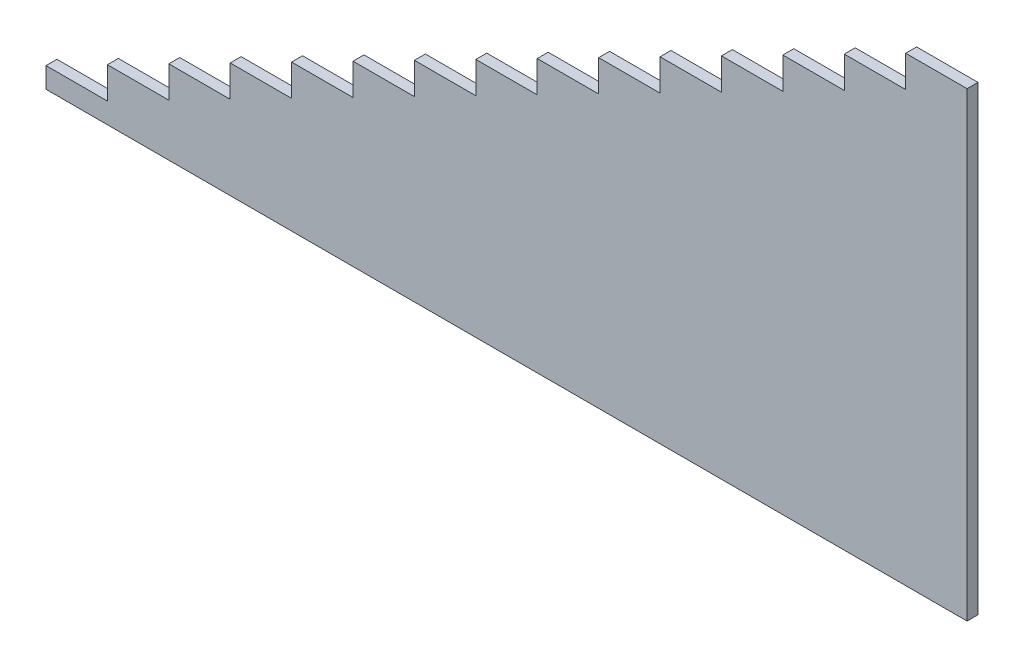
ISO-10303-21;
HEADER;
FILE_DESCRIPTION(('STEP AP214'),'2;1');
FILE_NAME('part.step','',(''),(''),'','','');
FILE_SCHEMA(('AUTOMOTIVE_DESIGN { 1 0 10303 214 1 1 1 1 }'));
ENDSEC;
DATA;
#1=APPLICATION_CONTEXT('core data for automotive mechanical design processes');
#2=APPLICATION_PROTOCOL_DEFINITION('international standard','automotive_design',2000,#1);
#3=PRODUCT_CONTEXT('',#1,'mechanical');
#4=PRODUCT('Part','Part','',(#3));
#5=PRODUCT_RELATED_PRODUCT_CATEGORY('part','',(#4));
#6=PRODUCT_DEFINITION_FORMATION('','',#4);
#7=PRODUCT_DEFINITION_CONTEXT('part definition',#1,'design');
#8=PRODUCT_DEFINITION('design','',#6,#7);
#9=PRODUCT_DEFINITION_SHAPE('','',#8);
#10=(LENGTH_UNIT() NAMED_UNIT(*) SI_UNIT(.MILLI.,.METRE.));
#11=(NAMED_UNIT(*) PLANE_ANGLE_UNIT() SI_UNIT($,.RADIAN.));
#12=(NAMED_UNIT(*) SI_UNIT($,.STERADIAN.) SOLID_ANGLE_UNIT());
#13=UNCERTAINTY_MEASURE_WITH_UNIT(LENGTH_MEASURE(1.E-05),#10,'distance_accuracy_value','');
#14=(GEOMETRIC_REPRESENTATION_CONTEXT(3) GLOBAL_UNCERTAINTY_ASSIGNED_CONTEXT((#13)) GLOBAL_UNIT_ASSIGNED_CONTEXT((#10,
#11,#12)) REPRESENTATION_CONTEXT('',''));
#15=CARTESIAN_POINT('',(0.,0.,0.));
#16=DIRECTION('',(0.,0.,1.));
#17=DIRECTION('',(1.,0.,0.));
#18=AXIS2_PLACEMENT_3D('',#15,#16,#17);
#19=CARTESIAN_POINT('',(0.,0.,12.7));
#20=DIRECTION('',(0.,-1.,0.));
#21=DIRECTION('',(1.,0.,0.));
#22=AXIS2_PLACEMENT_3D('',#19,#20,#21);
#23=PLANE('',#22);
#24=DIRECTION('',(-1.,0.,0.));
#25=VECTOR('',#24,1.);
#26=CARTESIAN_POINT('',(0.,0.,0.));
#27=LINE('',#26,#25);
#28=CARTESIAN_POINT('',(0.,0.,0.));
#29=VERTEX_POINT('',#28);
#30=CARTESIAN_POINT('',(-1070.61,6.10622663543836E-13,0.));
#31=VERTEX_POINT('',#30);
#32=EDGE_CURVE('E271',#29,#31,#27,.T.);
#33=ORIENTED_EDGE('',*,*,#32,.F.);
#34=DIRECTION('',(0.,0.,-1.));
#35=VECTOR('',#34,1.);
#36=CARTESIAN_POINT('',(0.,0.,12.7));
#37=LINE('',#36,#35);
#38=CARTESIAN_POINT('',(0.,0.,12.7));
#39=VERTEX_POINT('',#38);
#40=EDGE_CURVE('E11',#39,#29,#37,.T.);
#41=ORIENTED_EDGE('',*,*,#40,.F.);
#42=DIRECTION('',(-1.,0.,0.));
#43=VECTOR('',#42,1.);
#44=CARTESIAN_POINT('',(0.,0.,12.7));
#45=LINE('',#44,#43);
#46=CARTESIAN_POINT('',(-1070.61,6.10622663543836E-13,12.7));
#47=VERTEX_POINT('',#46);
#48=EDGE_CURVE('E338',#39,#47,#45,.T.);
#49=ORIENTED_EDGE('',*,*,#48,.T.);
#50=DIRECTION('',(0.,0.,-1.));
#51=VECTOR('',#50,1.);
#52=CARTESIAN_POINT('',(-1070.61,6.10622663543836E-13,12.7));
#53=LINE('',#52,#51);
#54=EDGE_CURVE('E157',#47,#31,#53,.T.);
#55=ORIENTED_EDGE('',*,*,#54,.T.);
#56=EDGE_LOOP('',(#33,#41,#49,#55));
#57=FACE_BOUND('',#56,.T.);
#58=ADVANCED_FACE('F34',(#57),#23,.T.);
#59=CARTESIAN_POINT('',(0.,0.,12.7));
#60=DIRECTION('',(-1.,0.,0.));
#61=DIRECTION('',(0.,-1.,0.));
#62=AXIS2_PLACEMENT_3D('',#59,#60,#61);
#63=PLANE('',#62);
#64=DIRECTION('',(0.,1.,0.));
#65=VECTOR('',#64,1.);
#66=CARTESIAN_POINT('',(0.,0.,0.));
#67=LINE('',#66,#65);
#68=CARTESIAN_POINT('',(0.,535.94,0.));
#69=VERTEX_POINT('',#68);
#70=EDGE_CURVE('E274',#29,#69,#67,.T.);
#71=ORIENTED_EDGE('',*,*,#70,.T.);
#72=DIRECTION('',(0.,0.,-1.));
#73=VECTOR('',#72,1.);
#74=CARTESIAN_POINT('',(0.,535.94,12.7));
#75=LINE('',#74,#73);
#76=CARTESIAN_POINT('',(0.,535.94,12.7));
#77=VERTEX_POINT('',#76);
#78=EDGE_CURVE('E42',#77,#69,#75,.T.);
#79=ORIENTED_EDGE('',*,*,#78,.F.);
#80=DIRECTION('',(0.,1.,0.));
#81=VECTOR('',#80,1.);
#82=CARTESIAN_POINT('',(0.,0.,12.7));
#83=LINE('',#82,#81);
#84=EDGE_CURVE('E440',#39,#77,#83,.T.);
#85=ORIENTED_EDGE('',*,*,#84,.F.);
#86=ORIENTED_EDGE('',*,*,#40,.T.);
#87=EDGE_LOOP('',(#71,#79,#85,#86));
#88=FACE_BOUND('',#87,.T.);
#89=ADVANCED_FACE('F425',(#88),#63,.F.);
#90=CARTESIAN_POINT('',(0.,535.94,12.7));
#91=DIRECTION('',(0.,1.,0.));
#92=DIRECTION('',(0.,0.,1.));
#93=AXIS2_PLACEMENT_3D('',#90,#91,#92);
#94=PLANE('',#93);
#95=DIRECTION('',(1.,0.,0.));
#96=VECTOR('',#95,1.);
#97=CARTESIAN_POINT('',(0.,535.94,0.));
#98=LINE('',#97,#96);
#99=CARTESIAN_POINT('',(-71.374,535.94,0.));
#100=VERTEX_POINT('',#99);
#101=EDGE_CURVE('E277',#100,#69,#98,.T.);
#102=ORIENTED_EDGE('',*,*,#101,.F.);
#103=DIRECTION('',(0.,0.,-1.));
#104=VECTOR('',#103,1.);
#105=CARTESIAN_POINT('',(-71.374,535.94,12.7));
#106=LINE('',#105,#104);
#107=CARTESIAN_POINT('',(-71.374,535.94,12.7));
#108=VERTEX_POINT('',#107);
#109=EDGE_CURVE('E415',#108,#100,#106,.T.);
#110=ORIENTED_EDGE('',*,*,#109,.F.);
#111=DIRECTION('',(1.,0.,0.));
#112=VECTOR('',#111,1.);
#113=CARTESIAN_POINT('',(0.,535.94,12.7));
#114=LINE('',#113,#112);
#115=EDGE_CURVE('E422',#108,#77,#114,.T.);
#116=ORIENTED_EDGE('',*,*,#115,.T.);
#117=ORIENTED_EDGE('',*,*,#78,.T.);
#118=EDGE_LOOP('',(#102,#110,#116,#117));
#119=FACE_BOUND('',#118,.T.);
#120=ADVANCED_FACE('F420',(#119),#94,.T.);
#121=CARTESIAN_POINT('',(-71.374,0.,12.7));
#122=DIRECTION('',(1.,0.,0.));
#123=DIRECTION('',(0.,0.,-1.));
#124=AXIS2_PLACEMENT_3D('',#121,#122,#123);
#125=PLANE('',#124);
#126=DIRECTION('',(0.,-1.,0.));
#127=VECTOR('',#126,1.);
#128=CARTESIAN_POINT('',(-71.374,0.,0.));
#129=LINE('',#128,#127);
#130=CARTESIAN_POINT('',(-71.374,499.364,0.));
#131=VERTEX_POINT('',#130);
#132=EDGE_CURVE('E280',#100,#131,#129,.T.);
#133=ORIENTED_EDGE('',*,*,#132,.T.);
#134=DIRECTION('',(0.,0.,-1.));
#135=VECTOR('',#134,1.);
#136=CARTESIAN_POINT('',(-71.374,499.364,12.7));
#137=LINE('',#136,#135);
#138=CARTESIAN_POINT('',(-71.374,499.364,12.7));
#139=VERTEX_POINT('',#138);
#140=EDGE_CURVE('E413',#139,#131,#137,.T.);
#141=ORIENTED_EDGE('',*,*,#140,.F.);
#142=DIRECTION('',(0.,-1.,0.));
#143=VECTOR('',#142,1.);
#144=CARTESIAN_POINT('',(-71.374,0.,12.7));
#145=LINE('',#144,#143);
#146=EDGE_CURVE('E436',#108,#139,#145,.T.);
#147=ORIENTED_EDGE('',*,*,#146,.F.);
#148=ORIENTED_EDGE('',*,*,#109,.T.);
#149=EDGE_LOOP('',(#133,#141,#147,#148));
#150=FACE_BOUND('',#149,.T.);
#151=ADVANCED_FACE('F433',(#150),#125,.F.);
#152=CARTESIAN_POINT('',(0.,499.364,12.7));
#153=DIRECTION('',(0.,1.,0.));
#154=DIRECTION('',(0.,0.,1.));
#155=AXIS2_PLACEMENT_3D('',#152,#153,#154);
#156=PLANE('',#155);
#157=DIRECTION('',(1.,0.,0.));
#158=VECTOR('',#157,1.);
#159=CARTESIAN_POINT('',(0.,499.364,0.));
#160=LINE('',#159,#158);
#161=CARTESIAN_POINT('',(-142.748,499.364,0.));
#162=VERTEX_POINT('',#161);
#163=EDGE_CURVE('E283',#162,#131,#160,.T.);
#164=ORIENTED_EDGE('',*,*,#163,.F.);
#165=DIRECTION('',(0.,0.,-1.));
#166=VECTOR('',#165,1.);
#167=CARTESIAN_POINT('',(-142.748,499.364,12.7));
#168=LINE('',#167,#166);
#169=CARTESIAN_POINT('',(-142.748,499.364,12.7));
#170=VERTEX_POINT('',#169);
#171=EDGE_CURVE('E411',#170,#162,#168,.T.);
#172=ORIENTED_EDGE('',*,*,#171,.F.);
#173=DIRECTION('',(1.,0.,0.));
#174=VECTOR('',#173,1.);
#175=CARTESIAN_POINT('',(0.,499.364,12.7));
#176=LINE('',#175,#174);
#177=EDGE_CURVE('E438',#170,#139,#176,.T.);
#178=ORIENTED_EDGE('',*,*,#177,.T.);
#179=ORIENTED_EDGE('',*,*,#140,.T.);
#180=EDGE_LOOP('',(#164,#172,#178,#179));
#181=FACE_BOUND('',#180,.T.);
#182=ADVANCED_FACE('F515',(#181),#156,.T.);
#183=CARTESIAN_POINT('',(-142.748000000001,3.31885819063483E-13,12.7));
#184=DIRECTION('',(1.,0.,0.));
#185=DIRECTION('',(0.,1.,0.));
#186=AXIS2_PLACEMENT_3D('',#183,#184,#185);
#187=PLANE('',#186);
#188=DIRECTION('',(0.,-1.,0.));
#189=VECTOR('',#188,1.);
#190=CARTESIAN_POINT('',(-142.748000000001,3.31885819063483E-13,0.));
#191=LINE('',#190,#189);
#192=CARTESIAN_POINT('',(-142.748,462.788,0.));
#193=VERTEX_POINT('',#192);
#194=EDGE_CURVE('E286',#162,#193,#191,.T.);
#195=ORIENTED_EDGE('',*,*,#194,.T.);
#196=DIRECTION('',(0.,0.,-1.));
#197=VECTOR('',#196,1.);
#198=CARTESIAN_POINT('',(-142.748,462.788,12.7));
#199=LINE('',#198,#197);
#200=CARTESIAN_POINT('',(-142.748,462.788,12.7));
#201=VERTEX_POINT('',#200);
#202=EDGE_CURVE('E408',#201,#193,#199,.T.);
#203=ORIENTED_EDGE('',*,*,#202,.F.);
#204=DIRECTION('',(0.,-1.,0.));
#205=VECTOR('',#204,1.);
#206=CARTESIAN_POINT('',(-142.748000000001,3.31885819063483E-13,12.7));
#207=LINE('',#206,#205);
#208=EDGE_CURVE('E446',#170,#201,#207,.T.);
#209=ORIENTED_EDGE('',*,*,#208,.F.);
#210=ORIENTED_EDGE('',*,*,#171,.T.);
#211=EDGE_LOOP('',(#195,#203,#209,#210));
#212=FACE_BOUND('',#211,.T.);
#213=ADVANCED_FACE('F518',(#212),#187,.F.);
#214=CARTESIAN_POINT('',(0.,462.788,12.7));
#215=DIRECTION('',(0.,-1.,0.));
#216=DIRECTION('',(0.,0.,-1.));
#217=AXIS2_PLACEMENT_3D('',#214,#215,#216);
#218=PLANE('',#217);
#219=DIRECTION('',(-1.,0.,0.));
#220=VECTOR('',#219,1.);
#221=CARTESIAN_POINT('',(0.,462.788,0.));
#222=LINE('',#221,#220);
#223=CARTESIAN_POINT('',(-214.122,462.788,0.));
#224=VERTEX_POINT('',#223);
#225=EDGE_CURVE('E288',#193,#224,#222,.T.);
#226=ORIENTED_EDGE('',*,*,#225,.T.);
#227=DIRECTION('',(0.,0.,-1.));
#228=VECTOR('',#227,1.);
#229=CARTESIAN_POINT('',(-214.122,462.788,12.7));
#230=LINE('',#229,#228);
#231=CARTESIAN_POINT('',(-214.122,462.788,12.7));
#232=VERTEX_POINT('',#231);
#233=EDGE_CURVE('E405',#232,#224,#230,.T.);
#234=ORIENTED_EDGE('',*,*,#233,.F.);
#235=DIRECTION('',(-1.,0.,0.));
#236=VECTOR('',#235,1.);
#237=CARTESIAN_POINT('',(0.,462.788,12.7));
#238=LINE('',#237,#236);
#239=EDGE_CURVE('E448',#201,#232,#238,.T.);
#240=ORIENTED_EDGE('',*,*,#239,.F.);
#241=ORIENTED_EDGE('',*,*,#202,.T.);
#242=EDGE_LOOP('',(#226,#234,#240,#241));
#243=FACE_BOUND('',#242,.T.);
#244=ADVANCED_FACE('F522',(#243),#218,.F.);
#245=CARTESIAN_POINT('',(-214.122,0.,12.7));
#246=DIRECTION('',(1.,0.,0.));
#247=DIRECTION('',(0.,0.,-1.));
#248=AXIS2_PLACEMENT_3D('',#245,#246,#247);
#249=PLANE('',#248);
#250=DIRECTION('',(0.,-1.,0.));
#251=VECTOR('',#250,1.);
#252=CARTESIAN_POINT('',(-214.122,0.,0.));
#253=LINE('',#252,#251);
#254=CARTESIAN_POINT('',(-214.122,426.212,0.));
#255=VERTEX_POINT('',#254);
#256=EDGE_CURVE('E290',#224,#255,#253,.T.);
#257=ORIENTED_EDGE('',*,*,#256,.T.);
#258=DIRECTION('',(0.,0.,-1.));
#259=VECTOR('',#258,1.);
#260=CARTESIAN_POINT('',(-214.122,426.212,12.7));
#261=LINE('',#260,#259);
#262=CARTESIAN_POINT('',(-214.122,426.212,12.7));
#263=VERTEX_POINT('',#262);
#264=EDGE_CURVE('E402',#263,#255,#261,.T.);
#265=ORIENTED_EDGE('',*,*,#264,.F.);
#266=DIRECTION('',(0.,-1.,0.));
#267=VECTOR('',#266,1.);
#268=CARTESIAN_POINT('',(-214.122,0.,12.7));
#269=LINE('',#268,#267);
#270=EDGE_CURVE('E450',#232,#263,#269,.T.);
#271=ORIENTED_EDGE('',*,*,#270,.F.);
#272=ORIENTED_EDGE('',*,*,#233,.T.);
#273=EDGE_LOOP('',(#257,#265,#271,#272));
#274=FACE_BOUND('',#273,.T.);
#275=ADVANCED_FACE('F526',(#274),#249,.F.);
#276=CARTESIAN_POINT('',(0.,426.212,12.7));
#277=DIRECTION('',(0.,-1.,0.));
#278=DIRECTION('',(0.,0.,-1.));
#279=AXIS2_PLACEMENT_3D('',#276,#277,#278);
#280=PLANE('',#279);
#281=DIRECTION('',(-1.,0.,0.));
#282=VECTOR('',#281,1.);
#283=CARTESIAN_POINT('',(0.,426.212,0.));
#284=LINE('',#283,#282);
#285=CARTESIAN_POINT('',(-285.496,426.212,0.));
#286=VERTEX_POINT('',#285);
#287=EDGE_CURVE('E292',#255,#286,#284,.T.);
#288=ORIENTED_EDGE('',*,*,#287,.T.);
#289=DIRECTION('',(0.,0.,-1.));
#290=VECTOR('',#289,1.);
#291=CARTESIAN_POINT('',(-285.496,426.212,12.7));
#292=LINE('',#291,#290);
#293=CARTESIAN_POINT('',(-285.496,426.212,12.7));
#294=VERTEX_POINT('',#293);
#295=EDGE_CURVE('E399',#294,#286,#292,.T.);
#296=ORIENTED_EDGE('',*,*,#295,.F.);
#297=DIRECTION('',(-1.,0.,0.));
#298=VECTOR('',#297,1.);
#299=CARTESIAN_POINT('',(0.,426.212,12.7));
#300=LINE('',#299,#298);
#301=EDGE_CURVE('E452',#263,#294,#300,.T.);
#302=ORIENTED_EDGE('',*,*,#301,.F.);
#303=ORIENTED_EDGE('',*,*,#264,.T.);
#304=EDGE_LOOP('',(#288,#296,#302,#303));
#305=FACE_BOUND('',#304,.T.);
#306=ADVANCED_FACE('F530',(#305),#280,.F.);
#307=CARTESIAN_POINT('',(-285.496000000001,6.63771638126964E-13,12.7));
#308=DIRECTION('',(1.,0.,0.));
#309=DIRECTION('',(0.,1.,0.));
#310=AXIS2_PLACEMENT_3D('',#307,#308,#309);
#311=PLANE('',#310);
#312=DIRECTION('',(0.,-1.,0.));
#313=VECTOR('',#312,1.);
#314=CARTESIAN_POINT('',(-285.496000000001,6.63771638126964E-13,0.));
#315=LINE('',#314,#313);
#316=CARTESIAN_POINT('',(-285.496,389.636,0.));
#317=VERTEX_POINT('',#316);
#318=EDGE_CURVE('E294',#286,#317,#315,.T.);
#319=ORIENTED_EDGE('',*,*,#318,.T.);
#320=DIRECTION('',(0.,0.,-1.));
#321=VECTOR('',#320,1.);
#322=CARTESIAN_POINT('',(-285.496,389.636,12.7));
#323=LINE('',#322,#321);
#324=CARTESIAN_POINT('',(-285.496,389.636,12.7));
#325=VERTEX_POINT('',#324);
#326=EDGE_CURVE('E396',#325,#317,#323,.T.);
#327=ORIENTED_EDGE('',*,*,#326,.F.);
#328=DIRECTION('',(0.,-1.,0.));
#329=VECTOR('',#328,1.);
#330=CARTESIAN_POINT('',(-285.496000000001,6.63771638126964E-13,12.7));
#331=LINE('',#330,#329);
#332=EDGE_CURVE('E454',#294,#325,#331,.T.);
#333=ORIENTED_EDGE('',*,*,#332,.F.);
#334=ORIENTED_EDGE('',*,*,#295,.T.);
#335=EDGE_LOOP('',(#319,#327,#333,#334));
#336=FACE_BOUND('',#335,.T.);
#337=ADVANCED_FACE('F534',(#336),#311,.F.);
#338=CARTESIAN_POINT('',(-3.03039523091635E-13,389.636,12.7));
#339=DIRECTION('',(0.,-1.,0.));
#340=DIRECTION('',(1.,0.,0.));
#341=AXIS2_PLACEMENT_3D('',#338,#339,#340);
#342=PLANE('',#341);
#343=DIRECTION('',(-1.,0.,0.));
#344=VECTOR('',#343,1.);
#345=CARTESIAN_POINT('',(-3.03039523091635E-13,389.636,0.));
#346=LINE('',#345,#344);
#347=CARTESIAN_POINT('',(-356.87,389.636,0.));
#348=VERTEX_POINT('',#347);
#349=EDGE_CURVE('E296',#317,#348,#346,.T.);
#350=ORIENTED_EDGE('',*,*,#349,.T.);
#351=DIRECTION('',(0.,0.,-1.));
#352=VECTOR('',#351,1.);
#353=CARTESIAN_POINT('',(-356.87,389.636,12.7));
#354=LINE('',#353,#352);
#355=CARTESIAN_POINT('',(-356.87,389.636,12.7));
#356=VERTEX_POINT('',#355);
#357=EDGE_CURVE('E393',#356,#348,#354,.T.);
#358=ORIENTED_EDGE('',*,*,#357,.F.);
#359=DIRECTION('',(-1.,0.,0.));
#360=VECTOR('',#359,1.);
#361=CARTESIAN_POINT('',(-3.03039523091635E-13,389.636,12.7));
#362=LINE('',#361,#360);
#363=EDGE_CURVE('E456',#325,#356,#362,.T.);
#364=ORIENTED_EDGE('',*,*,#363,.F.);
#365=ORIENTED_EDGE('',*,*,#326,.T.);
#366=EDGE_LOOP('',(#350,#358,#364,#365));
#367=FACE_BOUND('',#366,.T.);
#368=ADVANCED_FACE('F538',(#367),#342,.F.);
#369=CARTESIAN_POINT('',(-356.870000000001,8.29714547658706E-13,12.7));
#370=DIRECTION('',(1.,0.,0.));
#371=DIRECTION('',(0.,1.,0.));
#372=AXIS2_PLACEMENT_3D('',#369,#370,#371);
#373=PLANE('',#372);
#374=DIRECTION('',(0.,-1.,0.));
#375=VECTOR('',#374,1.);
#376=CARTESIAN_POINT('',(-356.870000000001,8.29714547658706E-13,0.));
#377=LINE('',#376,#375);
#378=CARTESIAN_POINT('',(-356.87,353.06,0.));
#379=VERTEX_POINT('',#378);
#380=EDGE_CURVE('E298',#348,#379,#377,.T.);
#381=ORIENTED_EDGE('',*,*,#380,.T.);
#382=DIRECTION('',(0.,0.,-1.));
#383=VECTOR('',#382,1.);
#384=CARTESIAN_POINT('',(-356.87,353.06,12.7));
#385=LINE('',#384,#383);
#386=CARTESIAN_POINT('',(-356.87,353.06,12.7));
#387=VERTEX_POINT('',#386);
#388=EDGE_CURVE('E390',#387,#379,#385,.T.);
#389=ORIENTED_EDGE('',*,*,#388,.F.);
#390=DIRECTION('',(0.,-1.,0.));
#391=VECTOR('',#390,1.);
#392=CARTESIAN_POINT('',(-356.870000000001,8.29714547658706E-13,12.7));
#393=LINE('',#392,#391);
#394=EDGE_CURVE('E458',#356,#387,#393,.T.);
#395=ORIENTED_EDGE('',*,*,#394,.F.);
#396=ORIENTED_EDGE('',*,*,#357,.T.);
#397=EDGE_LOOP('',(#381,#389,#395,#396));
#398=FACE_BOUND('',#397,.T.);
#399=ADVANCED_FACE('F542',(#398),#373,.F.);
#400=CARTESIAN_POINT('',(-2.74592527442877E-13,353.060000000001,12.7));
#401=DIRECTION('',(0.,-1.,0.));
#402=DIRECTION('',(1.,0.,0.));
#403=AXIS2_PLACEMENT_3D('',#400,#401,#402);
#404=PLANE('',#403);
#405=DIRECTION('',(-1.,0.,0.));
#406=VECTOR('',#405,1.);
#407=CARTESIAN_POINT('',(-2.74592527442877E-13,353.060000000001,0.));
#408=LINE('',#407,#406);
#409=CARTESIAN_POINT('',(-428.244,353.06,0.));
#410=VERTEX_POINT('',#409);
#411=EDGE_CURVE('E300',#379,#410,#408,.T.);
#412=ORIENTED_EDGE('',*,*,#411,.T.);
#413=DIRECTION('',(0.,0.,-1.));
#414=VECTOR('',#413,1.);
#415=CARTESIAN_POINT('',(-428.244,353.06,12.7));
#416=LINE('',#415,#414);
#417=CARTESIAN_POINT('',(-428.244,353.06,12.7));
#418=VERTEX_POINT('',#417);
#419=EDGE_CURVE('E387',#418,#410,#416,.T.);
#420=ORIENTED_EDGE('',*,*,#419,.F.);
#421=DIRECTION('',(-1.,0.,0.));
#422=VECTOR('',#421,1.);
#423=CARTESIAN_POINT('',(-2.74592527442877E-13,353.060000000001,12.7));
#424=LINE('',#423,#422);
#425=EDGE_CURVE('E460',#387,#418,#424,.T.);
#426=ORIENTED_EDGE('',*,*,#425,.F.);
#427=ORIENTED_EDGE('',*,*,#388,.T.);
#428=EDGE_LOOP('',(#412,#420,#426,#427));
#429=FACE_BOUND('',#428,.T.);
#430=ADVANCED_FACE('F546',(#429),#404,.F.);
#431=CARTESIAN_POINT('',(-428.244,0.,12.7));
#432=DIRECTION('',(1.,0.,0.));
#433=DIRECTION('',(0.,0.,-1.));
#434=AXIS2_PLACEMENT_3D('',#431,#432,#433);
#435=PLANE('',#434);
#436=DIRECTION('',(0.,-1.,0.));
#437=VECTOR('',#436,1.);
#438=CARTESIAN_POINT('',(-428.244,0.,0.));
#439=LINE('',#438,#437);
#440=CARTESIAN_POINT('',(-428.244,316.484,0.));
#441=VERTEX_POINT('',#440);
#442=EDGE_CURVE('E302',#410,#441,#439,.T.);
#443=ORIENTED_EDGE('',*,*,#442,.T.);
#444=DIRECTION('',(0.,0.,-1.));
#445=VECTOR('',#444,1.);
#446=CARTESIAN_POINT('',(-428.244,316.484,12.7));
#447=LINE('',#446,#445);
#448=CARTESIAN_POINT('',(-428.244,316.484,12.7));
#449=VERTEX_POINT('',#448);
#450=EDGE_CURVE('E384',#449,#441,#447,.T.);
#451=ORIENTED_EDGE('',*,*,#450,.F.);
#452=DIRECTION('',(0.,-1.,0.));
#453=VECTOR('',#452,1.);
#454=CARTESIAN_POINT('',(-428.244,0.,12.7));
#455=LINE('',#454,#453);
#456=EDGE_CURVE('E462',#418,#449,#455,.T.);
#457=ORIENTED_EDGE('',*,*,#456,.F.);
#458=ORIENTED_EDGE('',*,*,#419,.T.);
#459=EDGE_LOOP('',(#443,#451,#457,#458));
#460=FACE_BOUND('',#459,.T.);
#461=ADVANCED_FACE('F550',(#460),#435,.F.);
#462=CARTESIAN_POINT('',(-2.46145531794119E-13,316.484000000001,12.7));
#463=DIRECTION('',(0.,-1.,0.));
#464=DIRECTION('',(1.,0.,0.));
#465=AXIS2_PLACEMENT_3D('',#462,#463,#464);
#466=PLANE('',#465);
#467=DIRECTION('',(-1.,0.,0.));
#468=VECTOR('',#467,1.);
#469=CARTESIAN_POINT('',(-2.46145531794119E-13,316.484000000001,0.));
#470=LINE('',#469,#468);
#471=CARTESIAN_POINT('',(-499.618,316.484,0.));
#472=VERTEX_POINT('',#471);
#473=EDGE_CURVE('E304',#441,#472,#470,.T.);
#474=ORIENTED_EDGE('',*,*,#473,.T.);
#475=DIRECTION('',(0.,0.,-1.));
#476=VECTOR('',#475,1.);
#477=CARTESIAN_POINT('',(-499.618,316.484,12.7));
#478=LINE('',#477,#476);
#479=CARTESIAN_POINT('',(-499.618,316.484,12.7));
#480=VERTEX_POINT('',#479);
#481=EDGE_CURVE('E381',#480,#472,#478,.T.);
#482=ORIENTED_EDGE('',*,*,#481,.F.);
#483=DIRECTION('',(-1.,0.,0.));
#484=VECTOR('',#483,1.);
#485=CARTESIAN_POINT('',(-2.46145531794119E-13,316.484000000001,12.7));
#486=LINE('',#485,#484);
#487=EDGE_CURVE('E464',#449,#480,#486,.T.);
#488=ORIENTED_EDGE('',*,*,#487,.F.);
#489=ORIENTED_EDGE('',*,*,#450,.T.);
#490=EDGE_LOOP('',(#474,#482,#488,#489));
#491=FACE_BOUND('',#490,.T.);
#492=ADVANCED_FACE('F554',(#491),#466,.F.);
#493=CARTESIAN_POINT('',(-499.618000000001,1.16160036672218E-12,12.7));
#494=DIRECTION('',(1.,0.,0.));
#495=DIRECTION('',(0.,1.,0.));
#496=AXIS2_PLACEMENT_3D('',#493,#494,#495);
#497=PLANE('',#496);
#498=DIRECTION('',(0.,-1.,0.));
#499=VECTOR('',#498,1.);
#500=CARTESIAN_POINT('',(-499.618000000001,1.16160036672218E-12,0.));
#501=LINE('',#500,#499);
#502=CARTESIAN_POINT('',(-499.618,279.908,0.));
#503=VERTEX_POINT('',#502);
#504=EDGE_CURVE('E306',#472,#503,#501,.T.);
#505=ORIENTED_EDGE('',*,*,#504,.T.);
#506=DIRECTION('',(0.,0.,-1.));
#507=VECTOR('',#506,1.);
#508=CARTESIAN_POINT('',(-499.618,279.908,12.7));
#509=LINE('',#508,#507);
#510=CARTESIAN_POINT('',(-499.618,279.908,12.7));
#511=VERTEX_POINT('',#510);
#512=EDGE_CURVE('E378',#511,#503,#509,.T.);
#513=ORIENTED_EDGE('',*,*,#512,.F.);
#514=DIRECTION('',(0.,-1.,0.));
#515=VECTOR('',#514,1.);
#516=CARTESIAN_POINT('',(-499.618000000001,1.16160036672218E-12,12.7));
#517=LINE('',#516,#515);
#518=EDGE_CURVE('E466',#480,#511,#517,.T.);
#519=ORIENTED_EDGE('',*,*,#518,.F.);
#520=ORIENTED_EDGE('',*,*,#481,.T.);
#521=EDGE_LOOP('',(#505,#513,#519,#520));
#522=FACE_BOUND('',#521,.T.);
#523=ADVANCED_FACE('F558',(#522),#497,.F.);
#524=CARTESIAN_POINT('',(-2.17698536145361E-13,279.908000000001,12.7));
#525=DIRECTION('',(0.,-1.,0.));
#526=DIRECTION('',(1.,0.,0.));
#527=AXIS2_PLACEMENT_3D('',#524,#525,#526);
#528=PLANE('',#527);
#529=DIRECTION('',(-1.,0.,0.));
#530=VECTOR('',#529,1.);
#531=CARTESIAN_POINT('',(-2.17698536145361E-13,279.908000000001,0.));
#532=LINE('',#531,#530);
#533=CARTESIAN_POINT('',(-570.992,279.908,0.));
#534=VERTEX_POINT('',#533);
#535=EDGE_CURVE('E308',#503,#534,#532,.T.);
#536=ORIENTED_EDGE('',*,*,#535,.T.);
#537=DIRECTION('',(0.,0.,-1.));
#538=VECTOR('',#537,1.);
#539=CARTESIAN_POINT('',(-570.992,279.908,12.7));
#540=LINE('',#539,#538);
#541=CARTESIAN_POINT('',(-570.992,279.908,12.7));
#542=VERTEX_POINT('',#541);
#543=EDGE_CURVE('E375',#542,#534,#540,.T.);
#544=ORIENTED_EDGE('',*,*,#543,.F.);
#545=DIRECTION('',(-1.,0.,0.));
#546=VECTOR('',#545,1.);
#547=CARTESIAN_POINT('',(-2.17698536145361E-13,279.908000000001,12.7));
#548=LINE('',#547,#546);
#549=EDGE_CURVE('E468',#511,#542,#548,.T.);
#550=ORIENTED_EDGE('',*,*,#549,.F.);
#551=ORIENTED_EDGE('',*,*,#512,.T.);
#552=EDGE_LOOP('',(#536,#544,#550,#551));
#553=FACE_BOUND('',#552,.T.);
#554=ADVANCED_FACE('F562',(#553),#528,.F.);
#555=CARTESIAN_POINT('',(-570.992,0.,12.7));
#556=DIRECTION('',(1.,0.,0.));
#557=DIRECTION('',(0.,0.,-1.));
#558=AXIS2_PLACEMENT_3D('',#555,#556,#557);
#559=PLANE('',#558);
#560=DIRECTION('',(0.,-1.,0.));
#561=VECTOR('',#560,1.);
#562=CARTESIAN_POINT('',(-570.992,0.,0.));
#563=LINE('',#562,#561);
#564=CARTESIAN_POINT('',(-570.992,243.332000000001,0.));
#565=VERTEX_POINT('',#564);
#566=EDGE_CURVE('E310',#534,#565,#563,.T.);
#567=ORIENTED_EDGE('',*,*,#566,.T.);
#568=DIRECTION('',(0.,0.,-1.));
#569=VECTOR('',#568,1.);
#570=CARTESIAN_POINT('',(-570.992,243.332000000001,12.7));
#571=LINE('',#570,#569);
#572=CARTESIAN_POINT('',(-570.992,243.332000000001,12.7));
#573=VERTEX_POINT('',#572);
#574=EDGE_CURVE('E372',#573,#565,#571,.T.);
#575=ORIENTED_EDGE('',*,*,#574,.F.);
#576=DIRECTION('',(0.,-1.,0.));
#577=VECTOR('',#576,1.);
#578=CARTESIAN_POINT('',(-570.992,0.,12.7));
#579=LINE('',#578,#577);
#580=EDGE_CURVE('E470',#542,#573,#579,.T.);
#581=ORIENTED_EDGE('',*,*,#580,.F.);
#582=ORIENTED_EDGE('',*,*,#543,.T.);
#583=EDGE_LOOP('',(#567,#575,#581,#582));
#584=FACE_BOUND('',#583,.T.);
#585=ADVANCED_FACE('F566',(#584),#559,.F.);
#586=CARTESIAN_POINT('',(0.,243.332000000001,12.7));
#587=DIRECTION('',(0.,-1.,0.));
#588=DIRECTION('',(0.,0.,-1.));
#589=AXIS2_PLACEMENT_3D('',#586,#587,#588);
#590=PLANE('',#589);
#591=DIRECTION('',(-1.,0.,0.));
#592=VECTOR('',#591,1.);
#593=CARTESIAN_POINT('',(0.,243.332000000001,0.));
#594=LINE('',#593,#592);
#595=CARTESIAN_POINT('',(-642.366,243.332000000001,0.));
#596=VERTEX_POINT('',#595);
#597=EDGE_CURVE('E312',#565,#596,#594,.T.);
#598=ORIENTED_EDGE('',*,*,#597,.T.);
#599=DIRECTION('',(0.,0.,-1.));
#600=VECTOR('',#599,1.);
#601=CARTESIAN_POINT('',(-642.366,243.332000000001,12.7));
#602=LINE('',#601,#600);
#603=CARTESIAN_POINT('',(-642.366,243.332000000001,12.7));
#604=VERTEX_POINT('',#603);
#605=EDGE_CURVE('E369',#604,#596,#602,.T.);
#606=ORIENTED_EDGE('',*,*,#605,.F.);
#607=DIRECTION('',(-1.,0.,0.));
#608=VECTOR('',#607,1.);
#609=CARTESIAN_POINT('',(0.,243.332000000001,12.7));
#610=LINE('',#609,#608);
#611=EDGE_CURVE('E472',#573,#604,#610,.T.);
#612=ORIENTED_EDGE('',*,*,#611,.F.);
#613=ORIENTED_EDGE('',*,*,#574,.T.);
#614=EDGE_LOOP('',(#598,#606,#612,#613));
#615=FACE_BOUND('',#614,.T.);
#616=ADVANCED_FACE('F570',(#615),#590,.F.);
#617=CARTESIAN_POINT('',(-642.366,0.,12.7));
#618=DIRECTION('',(1.,0.,0.));
#619=DIRECTION('',(0.,0.,-1.));
#620=AXIS2_PLACEMENT_3D('',#617,#618,#619);
#621=PLANE('',#620);
#622=DIRECTION('',(0.,-1.,0.));
#623=VECTOR('',#622,1.);
#624=CARTESIAN_POINT('',(-642.366,0.,0.));
#625=LINE('',#624,#623);
#626=CARTESIAN_POINT('',(-642.366,206.756000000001,0.));
#627=VERTEX_POINT('',#626);
#628=EDGE_CURVE('E314',#596,#627,#625,.T.);
#629=ORIENTED_EDGE('',*,*,#628,.T.);
#630=DIRECTION('',(0.,0.,-1.));
#631=VECTOR('',#630,1.);
#632=CARTESIAN_POINT('',(-642.366,206.756000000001,12.7));
#633=LINE('',#632,#631);
#634=CARTESIAN_POINT('',(-642.366,206.756000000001,12.7));
#635=VERTEX_POINT('',#634);
#636=EDGE_CURVE('E366',#635,#627,#633,.T.);
#637=ORIENTED_EDGE('',*,*,#636,.F.);
#638=DIRECTION('',(0.,-1.,0.));
#639=VECTOR('',#638,1.);
#640=CARTESIAN_POINT('',(-642.366,0.,12.7));
#641=LINE('',#640,#639);
#642=EDGE_CURVE('E474',#604,#635,#641,.T.);
#643=ORIENTED_EDGE('',*,*,#642,.F.);
#644=ORIENTED_EDGE('',*,*,#605,.T.);
#645=EDGE_LOOP('',(#629,#637,#643,#644));
#646=FACE_BOUND('',#645,.T.);
#647=ADVANCED_FACE('F574',(#646),#621,.F.);
#648=CARTESIAN_POINT('',(0.,206.756000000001,12.7));
#649=DIRECTION('',(0.,-1.,0.));
#650=DIRECTION('',(1.,0.,0.));
#651=AXIS2_PLACEMENT_3D('',#648,#649,#650);
#652=PLANE('',#651);
#653=DIRECTION('',(-1.,0.,0.));
#654=VECTOR('',#653,1.);
#655=CARTESIAN_POINT('',(0.,206.756000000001,0.));
#656=LINE('',#655,#654);
#657=CARTESIAN_POINT('',(-713.74,206.756000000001,0.));
#658=VERTEX_POINT('',#657);
#659=EDGE_CURVE('E316',#627,#658,#656,.T.);
#660=ORIENTED_EDGE('',*,*,#659,.T.);
#661=DIRECTION('',(0.,0.,-1.));
#662=VECTOR('',#661,1.);
#663=CARTESIAN_POINT('',(-713.74,206.756000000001,12.7));
#664=LINE('',#663,#662);
#665=CARTESIAN_POINT('',(-713.74,206.756000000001,12.7));
#666=VERTEX_POINT('',#665);
#667=EDGE_CURVE('E363',#666,#658,#664,.T.);
#668=ORIENTED_EDGE('',*,*,#667,.F.);
#669=DIRECTION('',(-1.,0.,0.));
#670=VECTOR('',#669,1.);
#671=CARTESIAN_POINT('',(0.,206.756000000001,12.7));
#672=LINE('',#671,#670);
#673=EDGE_CURVE('E476',#635,#666,#672,.T.);
#674=ORIENTED_EDGE('',*,*,#673,.F.);
#675=ORIENTED_EDGE('',*,*,#636,.T.);
#676=EDGE_LOOP('',(#660,#668,#674,#675));
#677=FACE_BOUND('',#676,.T.);
#678=ADVANCED_FACE('F578',(#677),#652,.F.);
#679=CARTESIAN_POINT('',(-713.74,0.,12.7));
#680=DIRECTION('',(1.,0.,0.));
#681=DIRECTION('',(0.,0.,-1.));
#682=AXIS2_PLACEMENT_3D('',#679,#680,#681);
#683=PLANE('',#682);
#684=DIRECTION('',(0.,-1.,0.));
#685=VECTOR('',#684,1.);
#686=CARTESIAN_POINT('',(-713.74,0.,0.));
#687=LINE('',#686,#685);
#688=CARTESIAN_POINT('',(-713.74,170.180000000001,0.));
#689=VERTEX_POINT('',#688);
#690=EDGE_CURVE('E318',#658,#689,#687,.T.);
#691=ORIENTED_EDGE('',*,*,#690,.T.);
#692=DIRECTION('',(0.,0.,-1.));
#693=VECTOR('',#692,1.);
#694=CARTESIAN_POINT('',(-713.74,170.180000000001,12.7));
#695=LINE('',#694,#693);
#696=CARTESIAN_POINT('',(-713.74,170.180000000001,12.7));
#697=VERTEX_POINT('',#696);
#698=EDGE_CURVE('E360',#697,#689,#695,.T.);
#699=ORIENTED_EDGE('',*,*,#698,.F.);
#700=DIRECTION('',(0.,-1.,0.));
#701=VECTOR('',#700,1.);
#702=CARTESIAN_POINT('',(-713.74,0.,12.7));
#703=LINE('',#702,#701);
#704=EDGE_CURVE('E478',#666,#697,#703,.T.);
#705=ORIENTED_EDGE('',*,*,#704,.F.);
#706=ORIENTED_EDGE('',*,*,#667,.T.);
#707=EDGE_LOOP('',(#691,#699,#705,#706));
#708=FACE_BOUND('',#707,.T.);
#709=ADVANCED_FACE('F582',(#708),#683,.F.);
#710=CARTESIAN_POINT('',(0.,170.180000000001,12.7));
#711=DIRECTION('',(0.,-1.,0.));
#712=DIRECTION('',(0.,0.,-1.));
#713=AXIS2_PLACEMENT_3D('',#710,#711,#712);
#714=PLANE('',#713);
#715=DIRECTION('',(-1.,0.,0.));
#716=VECTOR('',#715,1.);
#717=CARTESIAN_POINT('',(0.,170.180000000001,0.));
#718=LINE('',#717,#716);
#719=CARTESIAN_POINT('',(-785.114,170.180000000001,0.));
#720=VERTEX_POINT('',#719);
#721=EDGE_CURVE('E320',#689,#720,#718,.T.);
#722=ORIENTED_EDGE('',*,*,#721,.T.);
#723=DIRECTION('',(0.,0.,-1.));
#724=VECTOR('',#723,1.);
#725=CARTESIAN_POINT('',(-785.114,170.180000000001,12.7));
#726=LINE('',#725,#724);
#727=CARTESIAN_POINT('',(-785.114,170.180000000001,12.7));
#728=VERTEX_POINT('',#727);
#729=EDGE_CURVE('E357',#728,#720,#726,.T.);
#730=ORIENTED_EDGE('',*,*,#729,.F.);
#731=DIRECTION('',(-1.,0.,0.));
#732=VECTOR('',#731,1.);
#733=CARTESIAN_POINT('',(0.,170.180000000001,12.7));
#734=LINE('',#733,#732);
#735=EDGE_CURVE('E480',#697,#728,#734,.T.);
#736=ORIENTED_EDGE('',*,*,#735,.F.);
#737=ORIENTED_EDGE('',*,*,#698,.T.);
#738=EDGE_LOOP('',(#722,#730,#736,#737));
#739=FACE_BOUND('',#738,.T.);
#740=ADVANCED_FACE('F586',(#739),#714,.F.);
#741=CARTESIAN_POINT('',(-785.114,0.,12.7));
#742=DIRECTION('',(1.,0.,0.));
#743=DIRECTION('',(0.,0.,-1.));
#744=AXIS2_PLACEMENT_3D('',#741,#742,#743);
#745=PLANE('',#744);
#746=DIRECTION('',(0.,-1.,0.));
#747=VECTOR('',#746,1.);
#748=CARTESIAN_POINT('',(-785.114,0.,0.));
#749=LINE('',#748,#747);
#750=CARTESIAN_POINT('',(-785.114,133.604000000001,0.));
#751=VERTEX_POINT('',#750);
#752=EDGE_CURVE('E322',#720,#751,#749,.T.);
#753=ORIENTED_EDGE('',*,*,#752,.T.);
#754=DIRECTION('',(0.,0.,-1.));
#755=VECTOR('',#754,1.);
#756=CARTESIAN_POINT('',(-785.114,133.604000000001,12.7));
#757=LINE('',#756,#755);
#758=CARTESIAN_POINT('',(-785.114,133.604000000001,12.7));
#759=VERTEX_POINT('',#758);
#760=EDGE_CURVE('E354',#759,#751,#757,.T.);
#761=ORIENTED_EDGE('',*,*,#760,.F.);
#762=DIRECTION('',(0.,-1.,0.));
#763=VECTOR('',#762,1.);
#764=CARTESIAN_POINT('',(-785.114,0.,12.7));
#765=LINE('',#764,#763);
#766=EDGE_CURVE('E482',#728,#759,#765,.T.);
#767=ORIENTED_EDGE('',*,*,#766,.F.);
#768=ORIENTED_EDGE('',*,*,#729,.T.);
#769=EDGE_LOOP('',(#753,#761,#767,#768));
#770=FACE_BOUND('',#769,.T.);
#771=ADVANCED_FACE('F590',(#770),#745,.F.);
#772=CARTESIAN_POINT('',(0.,133.604000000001,12.7));
#773=DIRECTION('',(0.,-1.,0.));
#774=DIRECTION('',(0.,0.,-1.));
#775=AXIS2_PLACEMENT_3D('',#772,#773,#774);
#776=PLANE('',#775);
#777=DIRECTION('',(-1.,0.,0.));
#778=VECTOR('',#777,1.);
#779=CARTESIAN_POINT('',(0.,133.604000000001,0.));
#780=LINE('',#779,#778);
#781=CARTESIAN_POINT('',(-856.488,133.604000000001,0.));
#782=VERTEX_POINT('',#781);
#783=EDGE_CURVE('E324',#751,#782,#780,.T.);
#784=ORIENTED_EDGE('',*,*,#783,.T.);
#785=DIRECTION('',(0.,0.,-1.));
#786=VECTOR('',#785,1.);
#787=CARTESIAN_POINT('',(-856.488,133.604000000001,12.7));
#788=LINE('',#787,#786);
#789=CARTESIAN_POINT('',(-856.488,133.604000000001,12.7));
#790=VERTEX_POINT('',#789);
#791=EDGE_CURVE('E351',#790,#782,#788,.T.);
#792=ORIENTED_EDGE('',*,*,#791,.F.);
#793=DIRECTION('',(-1.,0.,0.));
#794=VECTOR('',#793,1.);
#795=CARTESIAN_POINT('',(0.,133.604000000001,12.7));
#796=LINE('',#795,#794);
#797=EDGE_CURVE('E484',#759,#790,#796,.T.);
#798=ORIENTED_EDGE('',*,*,#797,.F.);
#799=ORIENTED_EDGE('',*,*,#760,.T.);
#800=EDGE_LOOP('',(#784,#792,#798,#799));
#801=FACE_BOUND('',#800,.T.);
#802=ADVANCED_FACE('F594',(#801),#776,.F.);
#803=CARTESIAN_POINT('',(-856.488,0.,12.7));
#804=DIRECTION('',(1.,0.,0.));
#805=DIRECTION('',(0.,0.,-1.));
#806=AXIS2_PLACEMENT_3D('',#803,#804,#805);
#807=PLANE('',#806);
#808=DIRECTION('',(0.,-1.,0.));
#809=VECTOR('',#808,1.);
#810=CARTESIAN_POINT('',(-856.488,0.,0.));
#811=LINE('',#810,#809);
#812=CARTESIAN_POINT('',(-856.488,97.0280000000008,0.));
#813=VERTEX_POINT('',#812);
#814=EDGE_CURVE('E326',#782,#813,#811,.T.);
#815=ORIENTED_EDGE('',*,*,#814,.T.);
#816=DIRECTION('',(0.,0.,-1.));
#817=VECTOR('',#816,1.);
#818=CARTESIAN_POINT('',(-856.488,97.0280000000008,12.7));
#819=LINE('',#818,#817);
#820=CARTESIAN_POINT('',(-856.488,97.0280000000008,12.7));
#821=VERTEX_POINT('',#820);
#822=EDGE_CURVE('E348',#821,#813,#819,.T.);
#823=ORIENTED_EDGE('',*,*,#822,.F.);
#824=DIRECTION('',(0.,-1.,0.));
#825=VECTOR('',#824,1.);
#826=CARTESIAN_POINT('',(-856.488,0.,12.7));
#827=LINE('',#826,#825);
#828=EDGE_CURVE('E486',#790,#821,#827,.T.);
#829=ORIENTED_EDGE('',*,*,#828,.F.);
#830=ORIENTED_EDGE('',*,*,#791,.T.);
#831=EDGE_LOOP('',(#815,#823,#829,#830));
#832=FACE_BOUND('',#831,.T.);
#833=ADVANCED_FACE('F598',(#832),#807,.F.);
#834=CARTESIAN_POINT('',(0.,97.028000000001,12.7));
#835=DIRECTION('',(0.,-1.,0.));
#836=DIRECTION('',(1.,0.,0.));
#837=AXIS2_PLACEMENT_3D('',#834,#835,#836);
#838=PLANE('',#837);
#839=DIRECTION('',(-1.,0.,0.));
#840=VECTOR('',#839,1.);
#841=CARTESIAN_POINT('',(0.,97.028000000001,0.));
#842=LINE('',#841,#840);
#843=CARTESIAN_POINT('',(-927.862,97.0280000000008,0.));
#844=VERTEX_POINT('',#843);
#845=EDGE_CURVE('E328',#813,#844,#842,.T.);
#846=ORIENTED_EDGE('',*,*,#845,.T.);
#847=DIRECTION('',(0.,0.,-1.));
#848=VECTOR('',#847,1.);
#849=CARTESIAN_POINT('',(-927.862,97.0280000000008,12.7));
#850=LINE('',#849,#848);
#851=CARTESIAN_POINT('',(-927.862,97.0280000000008,12.7));
#852=VERTEX_POINT('',#851);
#853=EDGE_CURVE('E345',#852,#844,#850,.T.);
#854=ORIENTED_EDGE('',*,*,#853,.F.);
#855=DIRECTION('',(-1.,0.,0.));
#856=VECTOR('',#855,1.);
#857=CARTESIAN_POINT('',(0.,97.028000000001,12.7));
#858=LINE('',#857,#856);
#859=EDGE_CURVE('E488',#821,#852,#858,.T.);
#860=ORIENTED_EDGE('',*,*,#859,.F.);
#861=ORIENTED_EDGE('',*,*,#822,.T.);
#862=EDGE_LOOP('',(#846,#854,#860,#861));
#863=FACE_BOUND('',#862,.T.);
#864=ADVANCED_FACE('F602',(#863),#838,.F.);
#865=CARTESIAN_POINT('',(-927.861999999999,-8.6290312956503E-12,12.7));
#866=DIRECTION('',(1.,0.,0.));
#867=DIRECTION('',(0.,1.,0.));
#868=AXIS2_PLACEMENT_3D('',#865,#866,#867);
#869=PLANE('',#868);
#870=DIRECTION('',(0.,-1.,0.));
#871=VECTOR('',#870,1.);
#872=CARTESIAN_POINT('',(-927.861999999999,-8.6290312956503E-12,0.));
#873=LINE('',#872,#871);
#874=CARTESIAN_POINT('',(-927.862,60.4520000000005,0.));
#875=VERTEX_POINT('',#874);
#876=EDGE_CURVE('E330',#844,#875,#873,.T.);
#877=ORIENTED_EDGE('',*,*,#876,.T.);
#878=DIRECTION('',(0.,0.,-1.));
#879=VECTOR('',#878,1.);
#880=CARTESIAN_POINT('',(-927.862,60.4520000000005,12.7));
#881=LINE('',#880,#879);
#882=CARTESIAN_POINT('',(-927.862,60.4520000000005,12.7));
#883=VERTEX_POINT('',#882);
#884=EDGE_CURVE('E342',#883,#875,#881,.T.);
#885=ORIENTED_EDGE('',*,*,#884,.F.);
#886=DIRECTION('',(0.,-1.,0.));
#887=VECTOR('',#886,1.);
#888=CARTESIAN_POINT('',(-927.861999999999,-8.6290312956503E-12,12.7));
#889=LINE('',#888,#887);
#890=EDGE_CURVE('E490',#852,#883,#889,.T.);
#891=ORIENTED_EDGE('',*,*,#890,.F.);
#892=ORIENTED_EDGE('',*,*,#853,.T.);
#893=EDGE_LOOP('',(#877,#885,#891,#892));
#894=FACE_BOUND('',#893,.T.);
#895=ADVANCED_FACE('F496',(#894),#869,.F.);
#896=CARTESIAN_POINT('',(0.,60.4520000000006,12.7));
#897=DIRECTION('',(0.,-1.,0.));
#898=DIRECTION('',(1.,0.,0.));
#899=AXIS2_PLACEMENT_3D('',#896,#897,#898);
#900=PLANE('',#899);
#901=DIRECTION('',(-1.,0.,0.));
#902=VECTOR('',#901,1.);
#903=CARTESIAN_POINT('',(0.,60.4520000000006,0.));
#904=LINE('',#903,#902);
#905=CARTESIAN_POINT('',(-999.236,60.4520000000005,0.));
#906=VERTEX_POINT('',#905);
#907=EDGE_CURVE('E332',#875,#906,#904,.T.);
#908=ORIENTED_EDGE('',*,*,#907,.T.);
#909=DIRECTION('',(0.,0.,-1.));
#910=VECTOR('',#909,1.);
#911=CARTESIAN_POINT('',(-999.236,60.4520000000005,12.7));
#912=LINE('',#911,#910);
#913=CARTESIAN_POINT('',(-999.236,60.4520000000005,12.7));
#914=VERTEX_POINT('',#913);
#915=EDGE_CURVE('E263',#914,#906,#912,.T.);
#916=ORIENTED_EDGE('',*,*,#915,.F.);
#917=DIRECTION('',(-1.,0.,0.));
#918=VECTOR('',#917,1.);
#919=CARTESIAN_POINT('',(0.,60.4520000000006,12.7));
#920=LINE('',#919,#918);
#921=EDGE_CURVE('E254',#883,#914,#920,.T.);
#922=ORIENTED_EDGE('',*,*,#921,.F.);
#923=ORIENTED_EDGE('',*,*,#884,.T.);
#924=EDGE_LOOP('',(#908,#916,#922,#923));
#925=FACE_BOUND('',#924,.T.);
#926=ADVANCED_FACE('F500',(#925),#900,.F.);
#927=CARTESIAN_POINT('',(-999.236,0.,12.7));
#928=DIRECTION('',(1.,0.,0.));
#929=DIRECTION('',(0.,0.,-1.));
#930=AXIS2_PLACEMENT_3D('',#927,#928,#929);
#931=PLANE('',#930);
#932=DIRECTION('',(0.,-1.,0.));
#933=VECTOR('',#932,1.);
#934=CARTESIAN_POINT('',(-999.236,0.,0.));
#935=LINE('',#934,#933);
#936=CARTESIAN_POINT('',(-999.236,23.8760000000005,0.));
#937=VERTEX_POINT('',#936);
#938=EDGE_CURVE('E262',#906,#937,#935,.T.);
#939=ORIENTED_EDGE('',*,*,#938,.T.);
#940=DIRECTION('',(0.,0.,-1.));
#941=VECTOR('',#940,1.);
#942=CARTESIAN_POINT('',(-999.236,23.8760000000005,12.7));
#943=LINE('',#942,#941);
#944=CARTESIAN_POINT('',(-999.236,23.8760000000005,12.7));
#945=VERTEX_POINT('',#944);
#946=EDGE_CURVE('E259',#945,#937,#943,.T.);
#947=ORIENTED_EDGE('',*,*,#946,.F.);
#948=DIRECTION('',(0.,-1.,0.));
#949=VECTOR('',#948,1.);
#950=CARTESIAN_POINT('',(-999.236,0.,12.7));
#951=LINE('',#950,#949);
#952=EDGE_CURVE('E248',#914,#945,#951,.T.);
#953=ORIENTED_EDGE('',*,*,#952,.F.);
#954=ORIENTED_EDGE('',*,*,#915,.T.);
#955=EDGE_LOOP('',(#939,#947,#953,#954));
#956=FACE_BOUND('',#955,.T.);
#957=ADVANCED_FACE('F260',(#956),#931,.F.);
#958=CARTESIAN_POINT('',(0.,23.8760000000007,12.7));
#959=DIRECTION('',(0.,-1.,0.));
#960=DIRECTION('',(1.,0.,0.));
#961=AXIS2_PLACEMENT_3D('',#958,#959,#960);
#962=PLANE('',#961);
#963=DIRECTION('',(-1.,0.,0.));
#964=VECTOR('',#963,1.);
#965=CARTESIAN_POINT('',(0.,23.8760000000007,0.));
#966=LINE('',#965,#964);
#967=CARTESIAN_POINT('',(-1070.61,23.8760000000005,0.));
#968=VERTEX_POINT('',#967);
#969=EDGE_CURVE('E150',#937,#968,#966,.T.);
#970=ORIENTED_EDGE('',*,*,#969,.T.);
#971=DIRECTION('',(0.,0.,-1.));
#972=VECTOR('',#971,1.);
#973=CARTESIAN_POINT('',(-1070.61,23.8760000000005,12.7));
#974=LINE('',#973,#972);
#975=CARTESIAN_POINT('',(-1070.61,23.8760000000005,12.7));
#976=VERTEX_POINT('',#975);
#977=EDGE_CURVE('E264',#976,#968,#974,.T.);
#978=ORIENTED_EDGE('',*,*,#977,.F.);
#979=DIRECTION('',(-1.,0.,0.));
#980=VECTOR('',#979,1.);
#981=CARTESIAN_POINT('',(0.,23.8760000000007,12.7));
#982=LINE('',#981,#980);
#983=EDGE_CURVE('E252',#945,#976,#982,.T.);
#984=ORIENTED_EDGE('',*,*,#983,.F.);
#985=ORIENTED_EDGE('',*,*,#946,.T.);
#986=EDGE_LOOP('',(#970,#978,#984,#985));
#987=FACE_BOUND('',#986,.T.);
#988=ADVANCED_FACE('F266',(#987),#962,.F.);
#989=CARTESIAN_POINT('',(-1070.61,0.,12.7));
#990=DIRECTION('',(1.,0.,0.));
#991=DIRECTION('',(0.,0.,-1.));
#992=AXIS2_PLACEMENT_3D('',#989,#990,#991);
#993=PLANE('',#992);
#994=DIRECTION('',(0.,-1.,0.));
#995=VECTOR('',#994,1.);
#996=CARTESIAN_POINT('',(-1070.61,0.,0.));
#997=LINE('',#996,#995);
#998=EDGE_CURVE('E336',#968,#31,#997,.T.);
#999=ORIENTED_EDGE('',*,*,#998,.T.);
#1000=ORIENTED_EDGE('',*,*,#54,.F.);
#1001=DIRECTION('',(0.,-1.,0.));
#1002=VECTOR('',#1001,1.);
#1003=CARTESIAN_POINT('',(-1070.61,0.,12.7));
#1004=LINE('',#1003,#1002);
#1005=EDGE_CURVE('E50',#976,#47,#1004,.T.);
#1006=ORIENTED_EDGE('',*,*,#1005,.F.);
#1007=ORIENTED_EDGE('',*,*,#977,.T.);
#1008=EDGE_LOOP('',(#999,#1000,#1006,#1007));
#1009=FACE_BOUND('',#1008,.T.);
#1010=ADVANCED_FACE('F503',(#1009),#993,.F.);
#1011=CARTESIAN_POINT('',(0.,0.,12.7));
#1012=DIRECTION('',(0.,0.,1.));
#1013=DIRECTION('',(1.,0.,0.));
#1014=AXIS2_PLACEMENT_3D('',#1011,#1012,#1013);
#1015=PLANE('',#1014);
#1016=ORIENTED_EDGE('',*,*,#48,.F.);
#1017=ORIENTED_EDGE('',*,*,#84,.T.);
#1018=ORIENTED_EDGE('',*,*,#115,.F.);
#1019=ORIENTED_EDGE('',*,*,#146,.T.);
#1020=ORIENTED_EDGE('',*,*,#177,.F.);
#1021=ORIENTED_EDGE('',*,*,#208,.T.);
#1022=ORIENTED_EDGE('',*,*,#239,.T.);
#1023=ORIENTED_EDGE('',*,*,#270,.T.);
#1024=ORIENTED_EDGE('',*,*,#301,.T.);
#1025=ORIENTED_EDGE('',*,*,#332,.T.);
#1026=ORIENTED_EDGE('',*,*,#363,.T.);
#1027=ORIENTED_EDGE('',*,*,#394,.T.);
#1028=ORIENTED_EDGE('',*,*,#425,.T.);
#1029=ORIENTED_EDGE('',*,*,#456,.T.);
#1030=ORIENTED_EDGE('',*,*,#487,.T.);
#1031=ORIENTED_EDGE('',*,*,#518,.T.);
#1032=ORIENTED_EDGE('',*,*,#549,.T.);
#1033=ORIENTED_EDGE('',*,*,#580,.T.);
#1034=ORIENTED_EDGE('',*,*,#611,.T.);
#1035=ORIENTED_EDGE('',*,*,#642,.T.);
#1036=ORIENTED_EDGE('',*,*,#673,.T.);
#1037=ORIENTED_EDGE('',*,*,#704,.T.);
#1038=ORIENTED_EDGE('',*,*,#735,.T.);
#1039=ORIENTED_EDGE('',*,*,#766,.T.);
#1040=ORIENTED_EDGE('',*,*,#797,.T.);
#1041=ORIENTED_EDGE('',*,*,#828,.T.);
#1042=ORIENTED_EDGE('',*,*,#859,.T.);
#1043=ORIENTED_EDGE('',*,*,#890,.T.);
#1044=ORIENTED_EDGE('',*,*,#921,.T.);
#1045=ORIENTED_EDGE('',*,*,#952,.T.);
#1046=ORIENTED_EDGE('',*,*,#983,.T.);
#1047=ORIENTED_EDGE('',*,*,#1005,.T.);
#1048=EDGE_LOOP('',(#1016,#1017,#1018,#1019,#1020,#1021,#1022,#1023,#1024,#1025,#1026,#1027,
#1028,#1029,#1030,#1031,#1032,#1033,#1034,#1035,#1036,#1037,#1038,#1039,#1040,#1041,#1042,#1043,
#1044,#1045,#1046,#1047));
#1049=FACE_BOUND('',#1048,.T.);
#1050=ADVANCED_FACE('F250',(#1049),#1015,.T.);
#1051=CARTESIAN_POINT('',(0.,0.,0.));
#1052=DIRECTION('',(0.,0.,1.));
#1053=DIRECTION('',(1.,0.,0.));
#1054=AXIS2_PLACEMENT_3D('',#1051,#1052,#1053);
#1055=PLANE('',#1054);
#1056=ORIENTED_EDGE('',*,*,#32,.T.);
#1057=ORIENTED_EDGE('',*,*,#998,.F.);
#1058=ORIENTED_EDGE('',*,*,#969,.F.);
#1059=ORIENTED_EDGE('',*,*,#938,.F.);
#1060=ORIENTED_EDGE('',*,*,#907,.F.);
#1061=ORIENTED_EDGE('',*,*,#876,.F.);
#1062=ORIENTED_EDGE('',*,*,#845,.F.);
#1063=ORIENTED_EDGE('',*,*,#814,.F.);
#1064=ORIENTED_EDGE('',*,*,#783,.F.);
#1065=ORIENTED_EDGE('',*,*,#752,.F.);
#1066=ORIENTED_EDGE('',*,*,#721,.F.);
#1067=ORIENTED_EDGE('',*,*,#690,.F.);
#1068=ORIENTED_EDGE('',*,*,#659,.F.);
#1069=ORIENTED_EDGE('',*,*,#628,.F.);
#1070=ORIENTED_EDGE('',*,*,#597,.F.);
#1071=ORIENTED_EDGE('',*,*,#566,.F.);
#1072=ORIENTED_EDGE('',*,*,#535,.F.);
#1073=ORIENTED_EDGE('',*,*,#504,.F.);
#1074=ORIENTED_EDGE('',*,*,#473,.F.);
#1075=ORIENTED_EDGE('',*,*,#442,.F.);
#1076=ORIENTED_EDGE('',*,*,#411,.F.);
#1077=ORIENTED_EDGE('',*,*,#380,.F.);
#1078=ORIENTED_EDGE('',*,*,#349,.F.);
#1079=ORIENTED_EDGE('',*,*,#318,.F.);
#1080=ORIENTED_EDGE('',*,*,#287,.F.);
#1081=ORIENTED_EDGE('',*,*,#256,.F.);
#1082=ORIENTED_EDGE('',*,*,#225,.F.);
#1083=ORIENTED_EDGE('',*,*,#194,.F.);
#1084=ORIENTED_EDGE('',*,*,#163,.T.);
#1085=ORIENTED_EDGE('',*,*,#132,.F.);
#1086=ORIENTED_EDGE('',*,*,#101,.T.);
#1087=ORIENTED_EDGE('',*,*,#70,.F.);
#1088=EDGE_LOOP('',(#1056,#1057,#1058,#1059,#1060,#1061,#1062,#1063,#1064,#1065,#1066,#1067,
#1068,#1069,#1070,#1071,#1072,#1073,#1074,#1075,#1076,#1077,#1078,#1079,#1080,#1081,#1082,#1083,
#1084,#1085,#1086,#1087));
#1089=FACE_BOUND('',#1088,.T.);
#1090=ADVANCED_FACE('F428',(#1089),#1055,.F.);
#1091=CLOSED_SHELL('',(#58,#89,#120,#151,#182,#213,#244,#275,#306,#337,#368,#399,#430,#461,#492,
#523,#554,#585,#616,#647,#678,#709,#740,#771,#802,#833,#864,#895,#926,#957,#988,#1010,#1050,#1090));
#1092=MANIFOLD_SOLID_BREP('B2',#1091);
#1093=ADVANCED_BREP_SHAPE_REPRESENTATION('',(#18,#1092),#14);
#1094=SHAPE_DEFINITION_REPRESENTATION(#9,#1093);
ENDSEC;
END-ISO-10303-21;
